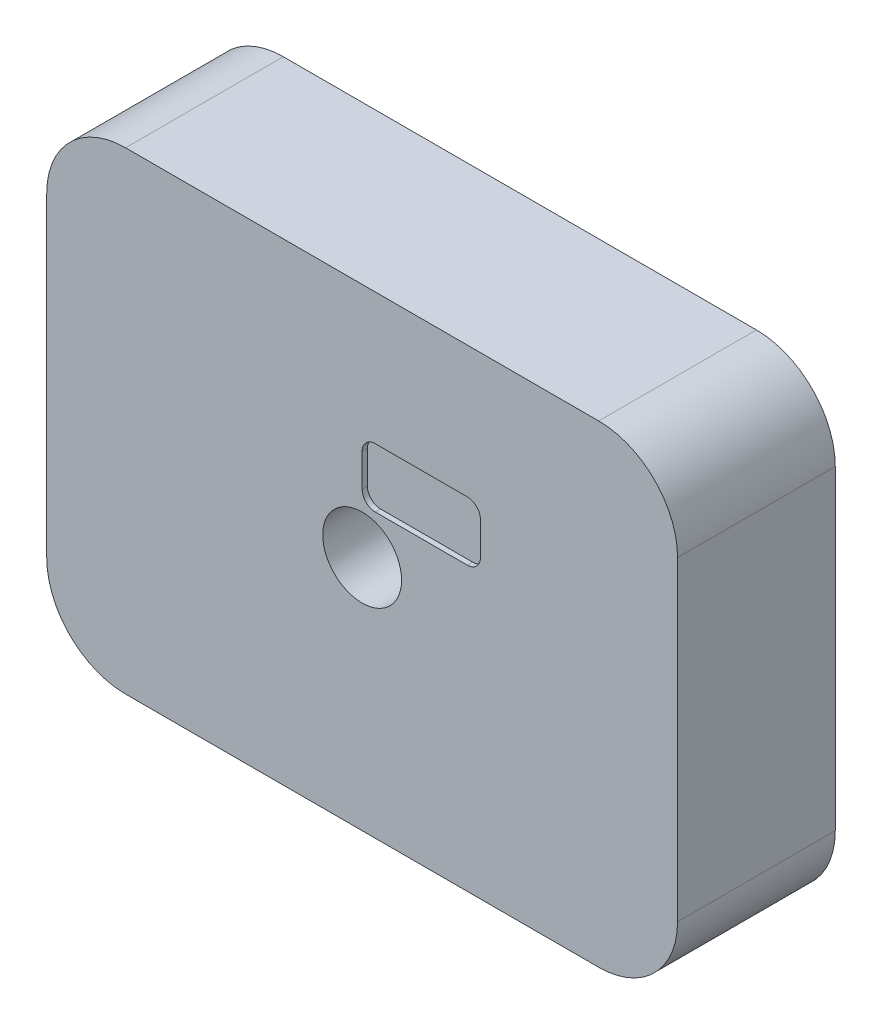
from build123d import *

# Parameters (mm, degrees)
ESQUISSE1_W             = 48
ESQUISSE1_H             = 36
EXTRUSION1_DEPTH        = 12
ESQUISSE12_R            = 3
ENL_V_MAT_EXTRU_5_DEPTH = 33.310988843
CHANFREIN1_SIZE         = 0.5
TROU_TARAUD_M41_D       = 3.3
TROU_TARAUD_M41_DEPTH   = 10.1
TROU_TARAUD_M41_TIP     = 0.991420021
CONG_1_R                = 6
ENL_V_MAT_EXTRU_4_DEPTH = 0.4


with BuildPart() as part:
    # Esquisse1 → Extrusion1 (new body)
    with BuildSketch(Plane.XY):
        Rectangle(ESQUISSE1_W, ESQUISSE1_H)
    extrude(amount=EXTRUSION1_DEPTH)

    # Esquisse12 → Enl_v. mat.-Extru.5 (cut, through all)
    with BuildSketch(Plane.XY.offset(12)):
        Circle(ESQUISSE12_R)
    extrude(amount=-ENL_V_MAT_EXTRU_5_DEPTH, mode=Mode.SUBTRACT)

    # Chanfrein1
    chanfrein1_edges = [part.edges().sort_by_distance(p)[0] for p in [
        (-3, 0, 0),
    ]]
    chamfer(chanfrein1_edges, length=CHANFREIN1_SIZE)

    # Trou taraud_ M41
    with Locations(Plane(origin=(0, 0, 0), x_dir=(-1, 0, 0), z_dir=(0, 0, -1))):
        with Locations((18, 12), (-18, 12), (-18, -12), (18, -12)):
            Hole(TROU_TARAUD_M41_D / 2, depth=TROU_TARAUD_M41_DEPTH)
            with Locations((0, 0, -(TROU_TARAUD_M41_DEPTH + TROU_TARAUD_M41_TIP / 2))):  # 118° drill point
                Cone(0, TROU_TARAUD_M41_D / 2, TROU_TARAUD_M41_TIP, mode=Mode.SUBTRACT)

    # Cong_1
    cong_1_edges = [part.edges().sort_by_distance(p)[0] for p in [
        (24, -18, 6),
        (-24, -18, 6),
        (-24, 18, 6),
        (24, 18, 6),
    ]]
    fillet(cong_1_edges, radius=CONG_1_R)

    # Esquisse8 → Enl_v. mat.-Extru.4 (cut)
    with BuildSketch(Plane.XY.offset(12)):
        with BuildLine():
            Line((1, 8), (8, 8))
            ThreePointArc((8, 8), (8.707106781, 7.707106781), (9, 7))
            Line((9, 7), (9, 4.5))
            ThreePointArc((9, 4.5), (8.707106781, 3.792893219), (8, 3.5))
            Line((8, 3.5), (1, 3.5))
            ThreePointArc((1, 3.5), (0.292893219, 3.792893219), (0, 4.5))
            Line((0, 4.5), (0, 7))
            ThreePointArc((0, 7), (0.292893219, 7.707106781), (1, 8))
        make_face()
    extrude(amount=-ENL_V_MAT_EXTRU_4_DEPTH, mode=Mode.SUBTRACT)


solid = part.part
